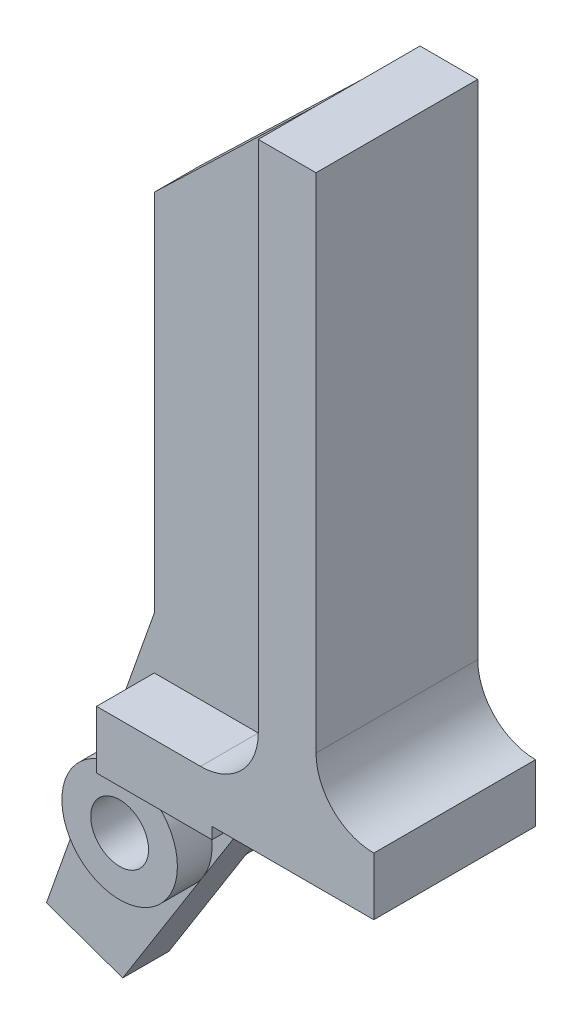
ISO-10303-21;
HEADER;
FILE_DESCRIPTION(('STEP AP214'),'2;1');
FILE_NAME('part.step','',(''),(''),'','','');
FILE_SCHEMA(('AUTOMOTIVE_DESIGN { 1 0 10303 214 1 1 1 1 }'));
ENDSEC;
DATA;
#1=APPLICATION_CONTEXT('core data for automotive mechanical design processes');
#2=APPLICATION_PROTOCOL_DEFINITION('international standard','automotive_design',2000,#1);
#3=PRODUCT_CONTEXT('',#1,'mechanical');
#4=PRODUCT('Part','Part','',(#3));
#5=PRODUCT_RELATED_PRODUCT_CATEGORY('part','',(#4));
#6=PRODUCT_DEFINITION_FORMATION('','',#4);
#7=PRODUCT_DEFINITION_CONTEXT('part definition',#1,'design');
#8=PRODUCT_DEFINITION('design','',#6,#7);
#9=PRODUCT_DEFINITION_SHAPE('','',#8);
#10=(LENGTH_UNIT() NAMED_UNIT(*) SI_UNIT(.MILLI.,.METRE.));
#11=(NAMED_UNIT(*) PLANE_ANGLE_UNIT() SI_UNIT($,.RADIAN.));
#12=(NAMED_UNIT(*) SI_UNIT($,.STERADIAN.) SOLID_ANGLE_UNIT());
#13=UNCERTAINTY_MEASURE_WITH_UNIT(LENGTH_MEASURE(1.E-05),#10,'distance_accuracy_value','');
#14=(GEOMETRIC_REPRESENTATION_CONTEXT(3) GLOBAL_UNCERTAINTY_ASSIGNED_CONTEXT((#13)) GLOBAL_UNIT_ASSIGNED_CONTEXT((#10,
#11,#12)) REPRESENTATION_CONTEXT('',''));
#15=CARTESIAN_POINT('',(0.,0.,0.));
#16=DIRECTION('',(0.,0.,1.));
#17=DIRECTION('',(1.,0.,0.));
#18=AXIS2_PLACEMENT_3D('',#15,#16,#17);
#19=CARTESIAN_POINT('',(-1.36683502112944,-6.86599324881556,1.));
#20=DIRECTION('',(-0.846365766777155,0.53260209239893,0.));
#21=DIRECTION('',(-0.53260209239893,-0.846365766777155,0.));
#22=AXIS2_PLACEMENT_3D('',#19,#20,#21);
#23=PLANE('',#22);
#24=DIRECTION('',(0.,0.,-1.));
#25=VECTOR('',#24,1.);
#26=CARTESIAN_POINT('',(4.68432905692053,2.75,1.));
#27=LINE('',#26,#25);
#28=CARTESIAN_POINT('',(4.68432905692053,2.75,1.));
#29=VERTEX_POINT('',#28);
#30=CARTESIAN_POINT('',(4.68432905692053,2.75,-1.));
#31=VERTEX_POINT('',#30);
#32=EDGE_CURVE('E224',#29,#31,#27,.T.);
#33=ORIENTED_EDGE('',*,*,#32,.F.);
#34=DIRECTION('',(0.53260209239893,0.846365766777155,0.));
#35=VECTOR('',#34,1.);
#36=CARTESIAN_POINT('',(-1.36683502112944,-6.86599324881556,1.));
#37=LINE('',#36,#35);
#38=CARTESIAN_POINT('',(2.11591441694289,-1.33150523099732,1.));
#39=VERTEX_POINT('',#38);
#40=EDGE_CURVE('E245',#39,#29,#37,.T.);
#41=ORIENTED_EDGE('',*,*,#40,.F.);
#42=CARTESIAN_POINT('',(-1.36683502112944,-6.86599324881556,1.));
#43=VERTEX_POINT('',#42);
#44=EDGE_CURVE('E246',#43,#39,#37,.T.);
#45=ORIENTED_EDGE('',*,*,#44,.F.);
#46=DIRECTION('',(0.,0.,-1.));
#47=VECTOR('',#46,1.);
#48=CARTESIAN_POINT('',(-1.36683502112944,-6.86599324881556,1.));
#49=LINE('',#48,#47);
#50=CARTESIAN_POINT('',(-1.36683502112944,-6.86599324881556,-1.));
#51=VERTEX_POINT('',#50);
#52=EDGE_CURVE('E269',#43,#51,#49,.T.);
#53=ORIENTED_EDGE('',*,*,#52,.T.);
#54=DIRECTION('',(0.53260209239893,0.846365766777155,0.));
#55=VECTOR('',#54,1.);
#56=CARTESIAN_POINT('',(-1.36683502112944,-6.86599324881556,-1.));
#57=LINE('',#56,#55);
#58=CARTESIAN_POINT('',(2.11591441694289,-1.33150523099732,-1.));
#59=VERTEX_POINT('',#58);
#60=EDGE_CURVE('E262',#51,#59,#57,.T.);
#61=ORIENTED_EDGE('',*,*,#60,.T.);
#62=EDGE_CURVE('E261',#59,#31,#57,.T.);
#63=ORIENTED_EDGE('',*,*,#62,.T.);
#64=EDGE_LOOP('',(#33,#41,#45,#53,#61,#63));
#65=FACE_BOUND('',#64,.T.);
#66=ADVANCED_FACE('F33',(#65),#23,.F.);
#67=CARTESIAN_POINT('',(-23.2883511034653,0.884433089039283,1.));
#68=DIRECTION('',(0.,0.,-1.));
#69=DIRECTION('',(-1.,0.,0.));
#70=AXIS2_PLACEMENT_3D('',#67,#68,#69);
#71=PLANE('',#70);
#72=CARTESIAN_POINT('',(4.5,7.75,1.));
#73=DIRECTION('',(0.,0.,-1.));
#74=DIRECTION('',(-1.,0.,0.));
#75=AXIS2_PLACEMENT_3D('',#72,#73,#74);
#76=CIRCLE('',#75,2.5);
#77=CARTESIAN_POINT('',(7.,7.75000000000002,1.));
#78=VERTEX_POINT('',#77);
#79=CARTESIAN_POINT('',(4.49999999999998,5.25,1.));
#80=VERTEX_POINT('',#79);
#81=EDGE_CURVE('E217',#78,#80,#76,.T.);
#82=ORIENTED_EDGE('',*,*,#81,.F.);
#83=DIRECTION('',(0.,1.,0.));
#84=VECTOR('',#83,1.);
#85=CARTESIAN_POINT('',(7.,30.,1.));
#86=LINE('',#85,#84);
#87=CARTESIAN_POINT('',(7.,30.,1.));
#88=VERTEX_POINT('',#87);
#89=EDGE_CURVE('E249',#78,#88,#86,.T.);
#90=ORIENTED_EDGE('',*,*,#89,.T.);
#91=DIRECTION('',(-0.720926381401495,-0.693011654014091,0.));
#92=VECTOR('',#91,1.);
#93=CARTESIAN_POINT('',(0.,23.2710444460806,1.));
#94=LINE('',#93,#92);
#95=CARTESIAN_POINT('',(0.,23.2710444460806,1.));
#96=VERTEX_POINT('',#95);
#97=EDGE_CURVE('E233',#88,#96,#94,.T.);
#98=ORIENTED_EDGE('',*,*,#97,.T.);
#99=DIRECTION('',(0.,-1.,0.));
#100=VECTOR('',#99,1.);
#101=CARTESIAN_POINT('',(0.,7.5,1.));
#102=LINE('',#101,#100);
#103=CARTESIAN_POINT('',(0.,7.5,1.));
#104=VERTEX_POINT('',#103);
#105=EDGE_CURVE('E236',#96,#104,#102,.T.);
#106=ORIENTED_EDGE('',*,*,#105,.T.);
#107=DIRECTION('',(-0.333333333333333,-0.942809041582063,0.));
#108=VECTOR('',#107,1.);
#109=CARTESIAN_POINT('',(-4.66666666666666,-5.69932658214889,1.));
#110=LINE('',#109,#108);
#111=CARTESIAN_POINT('',(-2.35702260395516,0.833333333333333,1.));
#112=VERTEX_POINT('',#111);
#113=EDGE_CURVE('E240',#104,#112,#110,.T.);
#114=ORIENTED_EDGE('',*,*,#113,.T.);
#115=CARTESIAN_POINT('',(0.,0.,1.));
#116=DIRECTION('',(0.,0.,-1.));
#117=DIRECTION('',(-1.,0.,0.));
#118=AXIS2_PLACEMENT_3D('',#115,#116,#117);
#119=CIRCLE('',#118,2.5);
#120=EDGE_CURVE('E285',#112,#39,#119,.T.);
#121=ORIENTED_EDGE('',*,*,#120,.T.);
#122=ORIENTED_EDGE('',*,*,#40,.T.);
#123=DIRECTION('',(1.,0.,0.));
#124=VECTOR('',#123,1.);
#125=CARTESIAN_POINT('',(-23.2883511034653,2.75,1.));
#126=LINE('',#125,#124);
#127=CARTESIAN_POINT('',(0.,2.75,1.));
#128=VERTEX_POINT('',#127);
#129=EDGE_CURVE('E226',#128,#29,#126,.T.);
#130=ORIENTED_EDGE('',*,*,#129,.F.);
#131=DIRECTION('',(0.,-1.,0.));
#132=VECTOR('',#131,1.);
#133=CARTESIAN_POINT('',(0.,0.884433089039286,1.));
#134=LINE('',#133,#132);
#135=CARTESIAN_POINT('',(0.,5.25,1.));
#136=VERTEX_POINT('',#135);
#137=EDGE_CURVE('E228',#136,#128,#134,.T.);
#138=ORIENTED_EDGE('',*,*,#137,.F.);
#139=DIRECTION('',(-1.,0.,0.));
#140=VECTOR('',#139,1.);
#141=CARTESIAN_POINT('',(-23.2883511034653,5.25,1.));
#142=LINE('',#141,#140);
#143=EDGE_CURVE('E230',#80,#136,#142,.T.);
#144=ORIENTED_EDGE('',*,*,#143,.F.);
#145=EDGE_LOOP('',(#82,#90,#98,#106,#114,#121,#122,#130,#138,#144));
#146=FACE_BOUND('',#145,.T.);
#147=ADVANCED_FACE('F420',(#146),#71,.F.);
#148=CARTESIAN_POINT('',(-23.2883511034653,0.884433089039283,-1.));
#149=DIRECTION('',(0.,0.,-1.));
#150=DIRECTION('',(-1.,0.,0.));
#151=AXIS2_PLACEMENT_3D('',#148,#149,#150);
#152=PLANE('',#151);
#153=DIRECTION('',(0.,1.,0.));
#154=VECTOR('',#153,1.);
#155=CARTESIAN_POINT('',(7.,30.,-1.));
#156=LINE('',#155,#154);
#157=CARTESIAN_POINT('',(7.,7.75000000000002,-1.));
#158=VERTEX_POINT('',#157);
#159=CARTESIAN_POINT('',(7.,30.,-1.));
#160=VERTEX_POINT('',#159);
#161=EDGE_CURVE('E237',#158,#160,#156,.T.);
#162=ORIENTED_EDGE('',*,*,#161,.F.);
#163=CARTESIAN_POINT('',(4.5,7.75,-1.));
#164=DIRECTION('',(0.,0.,-1.));
#165=DIRECTION('',(-1.,0.,0.));
#166=AXIS2_PLACEMENT_3D('',#163,#164,#165);
#167=CIRCLE('',#166,2.5);
#168=CARTESIAN_POINT('',(4.49999999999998,5.25,-1.));
#169=VERTEX_POINT('',#168);
#170=EDGE_CURVE('E214',#158,#169,#167,.T.);
#171=ORIENTED_EDGE('',*,*,#170,.T.);
#172=DIRECTION('',(-1.,0.,0.));
#173=VECTOR('',#172,1.);
#174=CARTESIAN_POINT('',(-23.2883511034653,5.25,-1.));
#175=LINE('',#174,#173);
#176=CARTESIAN_POINT('',(0.,5.25,-1.));
#177=VERTEX_POINT('',#176);
#178=EDGE_CURVE('E11',#169,#177,#175,.T.);
#179=ORIENTED_EDGE('',*,*,#178,.T.);
#180=DIRECTION('',(0.,-1.,0.));
#181=VECTOR('',#180,1.);
#182=CARTESIAN_POINT('',(0.,0.884433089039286,-1.));
#183=LINE('',#182,#181);
#184=CARTESIAN_POINT('',(0.,2.75,-1.));
#185=VERTEX_POINT('',#184);
#186=EDGE_CURVE('E41',#177,#185,#183,.T.);
#187=ORIENTED_EDGE('',*,*,#186,.T.);
#188=DIRECTION('',(1.,0.,0.));
#189=VECTOR('',#188,1.);
#190=CARTESIAN_POINT('',(-23.2883511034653,2.75,-1.));
#191=LINE('',#190,#189);
#192=EDGE_CURVE('E296',#185,#31,#191,.T.);
#193=ORIENTED_EDGE('',*,*,#192,.T.);
#194=ORIENTED_EDGE('',*,*,#62,.F.);
#195=CARTESIAN_POINT('',(0.,0.,-1.));
#196=DIRECTION('',(0.,0.,-1.));
#197=DIRECTION('',(-1.,0.,0.));
#198=AXIS2_PLACEMENT_3D('',#195,#196,#197);
#199=CIRCLE('',#198,2.5);
#200=CARTESIAN_POINT('',(-2.35702260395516,0.833333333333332,-1.));
#201=VERTEX_POINT('',#200);
#202=EDGE_CURVE('E283',#201,#59,#199,.T.);
#203=ORIENTED_EDGE('',*,*,#202,.F.);
#204=DIRECTION('',(-0.333333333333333,-0.942809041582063,0.));
#205=VECTOR('',#204,1.);
#206=CARTESIAN_POINT('',(-4.66666666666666,-5.69932658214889,-1.));
#207=LINE('',#206,#205);
#208=CARTESIAN_POINT('',(0.,7.5,-1.));
#209=VERTEX_POINT('',#208);
#210=EDGE_CURVE('E48',#209,#201,#207,.T.);
#211=ORIENTED_EDGE('',*,*,#210,.F.);
#212=DIRECTION('',(0.,-1.,0.));
#213=VECTOR('',#212,1.);
#214=CARTESIAN_POINT('',(0.,7.5,-1.));
#215=LINE('',#214,#213);
#216=CARTESIAN_POINT('',(0.,23.2710444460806,-1.));
#217=VERTEX_POINT('',#216);
#218=EDGE_CURVE('E255',#217,#209,#215,.T.);
#219=ORIENTED_EDGE('',*,*,#218,.F.);
#220=DIRECTION('',(-0.720926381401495,-0.693011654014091,0.));
#221=VECTOR('',#220,1.);
#222=CARTESIAN_POINT('',(0.,23.2710444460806,-1.));
#223=LINE('',#222,#221);
#224=EDGE_CURVE('E232',#160,#217,#223,.T.);
#225=ORIENTED_EDGE('',*,*,#224,.F.);
#226=EDGE_LOOP('',(#162,#171,#179,#187,#193,#194,#203,#211,#219,#225));
#227=FACE_BOUND('',#226,.T.);
#228=ADVANCED_FACE('F303',(#227),#152,.T.);
#229=CARTESIAN_POINT('',(0.,0.,2.5));
#230=DIRECTION('',(0.,0.,-1.));
#231=DIRECTION('',(-1.,0.,0.));
#232=AXIS2_PLACEMENT_3D('',#229,#230,#231);
#233=CYLINDRICAL_SURFACE('',#232,2.5);
#234=CARTESIAN_POINT('',(0.,0.,2.5));
#235=DIRECTION('',(0.,0.,1.));
#236=DIRECTION('',(1.,0.,0.));
#237=AXIS2_PLACEMENT_3D('',#234,#235,#236);
#238=CIRCLE('',#237,2.5);
#239=CARTESIAN_POINT('',(2.5,0.,2.5));
#240=VERTEX_POINT('',#239);
#241=EDGE_CURVE('E293',#240,#240,#238,.T.);
#242=ORIENTED_EDGE('',*,*,#241,.F.);
#243=EDGE_LOOP('',(#242));
#244=FACE_BOUND('',#243,.T.);
#245=ORIENTED_EDGE('',*,*,#120,.F.);
#246=EDGE_CURVE('E55',#39,#112,#119,.T.);
#247=ORIENTED_EDGE('',*,*,#246,.F.);
#248=EDGE_LOOP('',(#245,#247));
#249=FACE_BOUND('',#248,.T.);
#250=ADVANCED_FACE('F444',(#244,#249),#233,.T.);
#251=CARTESIAN_POINT('',(0.,0.,2.5));
#252=DIRECTION('',(0.,0.,1.));
#253=DIRECTION('',(1.,0.,0.));
#254=AXIS2_PLACEMENT_3D('',#251,#252,#253);
#255=PLANE('',#254);
#256=ORIENTED_EDGE('',*,*,#241,.T.);
#257=EDGE_LOOP('',(#256));
#258=FACE_BOUND('',#257,.T.);
#259=CARTESIAN_POINT('',(0.,0.,2.5));
#260=DIRECTION('',(0.,0.,1.));
#261=DIRECTION('',(1.,0.,0.));
#262=AXIS2_PLACEMENT_3D('',#259,#260,#261);
#263=CIRCLE('',#262,1.25);
#264=CARTESIAN_POINT('',(1.25,0.,2.5));
#265=VERTEX_POINT('',#264);
#266=EDGE_CURVE('E286',#265,#265,#263,.T.);
#267=ORIENTED_EDGE('',*,*,#266,.F.);
#268=EDGE_LOOP('',(#267));
#269=FACE_BOUND('',#268,.T.);
#270=ADVANCED_FACE('F449',(#258,#269),#255,.T.);
#271=CARTESIAN_POINT('',(0.,0.,-2.5));
#272=DIRECTION('',(0.,0.,1.));
#273=DIRECTION('',(1.,0.,0.));
#274=AXIS2_PLACEMENT_3D('',#271,#272,#273);
#275=PLANE('',#274);
#276=CARTESIAN_POINT('',(0.,0.,-2.5));
#277=DIRECTION('',(0.,0.,1.));
#278=DIRECTION('',(1.,0.,0.));
#279=AXIS2_PLACEMENT_3D('',#276,#277,#278);
#280=CIRCLE('',#279,2.5);
#281=CARTESIAN_POINT('',(2.5,0.,-2.5));
#282=VERTEX_POINT('',#281);
#283=EDGE_CURVE('E289',#282,#282,#280,.T.);
#284=ORIENTED_EDGE('',*,*,#283,.F.);
#285=EDGE_LOOP('',(#284));
#286=FACE_BOUND('',#285,.T.);
#287=CARTESIAN_POINT('',(0.,0.,-2.5));
#288=DIRECTION('',(0.,0.,1.));
#289=DIRECTION('',(1.,0.,0.));
#290=AXIS2_PLACEMENT_3D('',#287,#288,#289);
#291=CIRCLE('',#290,1.25);
#292=CARTESIAN_POINT('',(1.25,0.,-2.5));
#293=VERTEX_POINT('',#292);
#294=EDGE_CURVE('E290',#293,#293,#291,.T.);
#295=ORIENTED_EDGE('',*,*,#294,.T.);
#296=EDGE_LOOP('',(#295));
#297=FACE_BOUND('',#296,.T.);
#298=ADVANCED_FACE('F443',(#286,#297),#275,.F.);
#299=EDGE_CURVE('E280',#59,#201,#199,.T.);
#300=ORIENTED_EDGE('',*,*,#299,.T.);
#301=ORIENTED_EDGE('',*,*,#202,.T.);
#302=EDGE_LOOP('',(#300,#301));
#303=FACE_BOUND('',#302,.T.);
#304=ORIENTED_EDGE('',*,*,#283,.T.);
#305=EDGE_LOOP('',(#304));
#306=FACE_BOUND('',#305,.T.);
#307=ADVANCED_FACE('F35',(#303,#306),#233,.T.);
#308=CARTESIAN_POINT('',(0.,0.,2.5));
#309=DIRECTION('',(0.,0.,-1.));
#310=DIRECTION('',(-1.,0.,0.));
#311=AXIS2_PLACEMENT_3D('',#308,#309,#310);
#312=CYLINDRICAL_SURFACE('',#311,1.25);
#313=ORIENTED_EDGE('',*,*,#294,.F.);
#314=EDGE_LOOP('',(#313));
#315=FACE_BOUND('',#314,.T.);
#316=ORIENTED_EDGE('',*,*,#266,.T.);
#317=EDGE_LOOP('',(#316));
#318=FACE_BOUND('',#317,.T.);
#319=ADVANCED_FACE('F442',(#315,#318),#312,.F.);
#320=CARTESIAN_POINT('',(-4.66666666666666,-5.69932658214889,1.));
#321=DIRECTION('',(0.942809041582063,-0.333333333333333,0.));
#322=DIRECTION('',(0.333333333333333,0.942809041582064,0.));
#323=AXIS2_PLACEMENT_3D('',#320,#321,#322);
#324=PLANE('',#323);
#325=CARTESIAN_POINT('',(-4.66666666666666,-5.69932658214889,1.));
#326=VERTEX_POINT('',#325);
#327=EDGE_CURVE('E239',#112,#326,#110,.T.);
#328=ORIENTED_EDGE('',*,*,#327,.F.);
#329=ORIENTED_EDGE('',*,*,#113,.F.);
#330=DIRECTION('',(0.,0.,-1.));
#331=VECTOR('',#330,1.);
#332=CARTESIAN_POINT('',(0.,7.5,1.));
#333=LINE('',#332,#331);
#334=EDGE_CURVE('E275',#104,#209,#333,.T.);
#335=ORIENTED_EDGE('',*,*,#334,.T.);
#336=ORIENTED_EDGE('',*,*,#210,.T.);
#337=CARTESIAN_POINT('',(-4.66666666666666,-5.69932658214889,-1.));
#338=VERTEX_POINT('',#337);
#339=EDGE_CURVE('E257',#201,#338,#207,.T.);
#340=ORIENTED_EDGE('',*,*,#339,.T.);
#341=DIRECTION('',(0.,0.,-1.));
#342=VECTOR('',#341,1.);
#343=CARTESIAN_POINT('',(-4.66666666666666,-5.69932658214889,1.));
#344=LINE('',#343,#342);
#345=EDGE_CURVE('E272',#326,#338,#344,.T.);
#346=ORIENTED_EDGE('',*,*,#345,.F.);
#347=EDGE_LOOP('',(#328,#329,#335,#336,#340,#346));
#348=FACE_BOUND('',#347,.T.);
#349=ADVANCED_FACE('F454',(#348),#324,.F.);
#350=ORIENTED_EDGE('',*,*,#44,.T.);
#351=ORIENTED_EDGE('',*,*,#246,.T.);
#352=ORIENTED_EDGE('',*,*,#327,.T.);
#353=DIRECTION('',(0.942809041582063,-0.333333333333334,0.));
#354=VECTOR('',#353,1.);
#355=CARTESIAN_POINT('',(-4.66666666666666,-5.69932658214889,1.));
#356=LINE('',#355,#354);
#357=EDGE_CURVE('E243',#326,#43,#356,.T.);
#358=ORIENTED_EDGE('',*,*,#357,.T.);
#359=EDGE_LOOP('',(#350,#351,#352,#358));
#360=FACE_BOUND('',#359,.T.);
#361=ADVANCED_FACE('F426',(#360),#71,.F.);
#362=ORIENTED_EDGE('',*,*,#299,.F.);
#363=ORIENTED_EDGE('',*,*,#60,.F.);
#364=DIRECTION('',(0.942809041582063,-0.333333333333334,0.));
#365=VECTOR('',#364,1.);
#366=CARTESIAN_POINT('',(-4.66666666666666,-5.69932658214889,-1.));
#367=LINE('',#366,#365);
#368=EDGE_CURVE('E259',#338,#51,#367,.T.);
#369=ORIENTED_EDGE('',*,*,#368,.F.);
#370=ORIENTED_EDGE('',*,*,#339,.F.);
#371=EDGE_LOOP('',(#362,#363,#369,#370));
#372=FACE_BOUND('',#371,.T.);
#373=ADVANCED_FACE('F437',(#372),#152,.T.);
#374=CARTESIAN_POINT('',(0.,23.2710444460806,1.));
#375=DIRECTION('',(0.693011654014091,-0.720926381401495,0.));
#376=DIRECTION('',(0.720926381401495,0.693011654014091,0.));
#377=AXIS2_PLACEMENT_3D('',#374,#375,#376);
#378=PLANE('',#377);
#379=ORIENTED_EDGE('',*,*,#224,.T.);
#380=DIRECTION('',(0.,0.,-1.));
#381=VECTOR('',#380,1.);
#382=CARTESIAN_POINT('',(0.,23.2710444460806,1.));
#383=LINE('',#382,#381);
#384=EDGE_CURVE('E277',#96,#217,#383,.T.);
#385=ORIENTED_EDGE('',*,*,#384,.F.);
#386=ORIENTED_EDGE('',*,*,#97,.F.);
#387=DIRECTION('',(0.,0.,-1.));
#388=VECTOR('',#387,1.);
#389=CARTESIAN_POINT('',(7.,30.,1.));
#390=LINE('',#389,#388);
#391=EDGE_CURVE('E252',#88,#160,#390,.T.);
#392=ORIENTED_EDGE('',*,*,#391,.T.);
#393=EDGE_LOOP('',(#379,#385,#386,#392));
#394=FACE_BOUND('',#393,.T.);
#395=ADVANCED_FACE('F481',(#394),#378,.F.);
#396=CARTESIAN_POINT('',(0.,7.5,1.));
#397=DIRECTION('',(1.,0.,0.));
#398=DIRECTION('',(0.,0.,-1.));
#399=AXIS2_PLACEMENT_3D('',#396,#397,#398);
#400=PLANE('',#399);
#401=ORIENTED_EDGE('',*,*,#218,.T.);
#402=ORIENTED_EDGE('',*,*,#334,.F.);
#403=ORIENTED_EDGE('',*,*,#105,.F.);
#404=ORIENTED_EDGE('',*,*,#384,.T.);
#405=EDGE_LOOP('',(#401,#402,#403,#404));
#406=FACE_BOUND('',#405,.T.);
#407=ADVANCED_FACE('F476',(#406),#400,.F.);
#408=CARTESIAN_POINT('',(-4.66666666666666,-5.69932658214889,1.));
#409=DIRECTION('',(0.333333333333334,0.942809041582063,0.));
#410=DIRECTION('',(-0.942809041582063,0.333333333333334,0.));
#411=AXIS2_PLACEMENT_3D('',#408,#409,#410);
#412=PLANE('',#411);
#413=ORIENTED_EDGE('',*,*,#368,.T.);
#414=ORIENTED_EDGE('',*,*,#52,.F.);
#415=ORIENTED_EDGE('',*,*,#357,.F.);
#416=ORIENTED_EDGE('',*,*,#345,.T.);
#417=EDGE_LOOP('',(#413,#414,#415,#416));
#418=FACE_BOUND('',#417,.T.);
#419=ADVANCED_FACE('F432',(#418),#412,.F.);
#420=CARTESIAN_POINT('',(0.,5.25,3.5));
#421=DIRECTION('',(0.,-1.,0.));
#422=DIRECTION('',(1.,0.,0.));
#423=AXIS2_PLACEMENT_3D('',#420,#421,#422);
#424=PLANE('',#423);
#425=DIRECTION('',(0.,0.,-1.));
#426=VECTOR('',#425,1.);
#427=CARTESIAN_POINT('',(4.49999999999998,5.25,3.5));
#428=LINE('',#427,#426);
#429=CARTESIAN_POINT('',(4.49999999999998,5.25,3.5));
#430=VERTEX_POINT('',#429);
#431=EDGE_CURVE('E329',#430,#80,#428,.T.);
#432=ORIENTED_EDGE('',*,*,#431,.T.);
#433=ORIENTED_EDGE('',*,*,#143,.T.);
#434=DIRECTION('',(0.,0.,-1.));
#435=VECTOR('',#434,1.);
#436=CARTESIAN_POINT('',(0.,5.25,3.5));
#437=LINE('',#436,#435);
#438=CARTESIAN_POINT('',(0.,5.25,3.5));
#439=VERTEX_POINT('',#438);
#440=EDGE_CURVE('E320',#439,#136,#437,.T.);
#441=ORIENTED_EDGE('',*,*,#440,.F.);
#442=DIRECTION('',(-1.,0.,0.));
#443=VECTOR('',#442,1.);
#444=CARTESIAN_POINT('',(0.,5.25,3.5));
#445=LINE('',#444,#443);
#446=EDGE_CURVE('E407',#430,#439,#445,.T.);
#447=ORIENTED_EDGE('',*,*,#446,.F.);
#448=EDGE_LOOP('',(#432,#433,#441,#447));
#449=FACE_BOUND('',#448,.T.);
#450=ADVANCED_FACE('F475',(#449),#424,.F.);
#451=CARTESIAN_POINT('',(0.,5.25,3.5));
#452=DIRECTION('',(1.,0.,0.));
#453=DIRECTION('',(0.,1.,0.));
#454=AXIS2_PLACEMENT_3D('',#451,#452,#453);
#455=PLANE('',#454);
#456=ORIENTED_EDGE('',*,*,#440,.T.);
#457=ORIENTED_EDGE('',*,*,#137,.T.);
#458=DIRECTION('',(0.,0.,-1.));
#459=VECTOR('',#458,1.);
#460=CARTESIAN_POINT('',(0.,2.75,3.5));
#461=LINE('',#460,#459);
#462=CARTESIAN_POINT('',(0.,2.75,3.5));
#463=VERTEX_POINT('',#462);
#464=EDGE_CURVE('E321',#463,#128,#461,.T.);
#465=ORIENTED_EDGE('',*,*,#464,.F.);
#466=DIRECTION('',(0.,-1.,0.));
#467=VECTOR('',#466,1.);
#468=CARTESIAN_POINT('',(0.,5.25,3.5));
#469=LINE('',#468,#467);
#470=EDGE_CURVE('E409',#439,#463,#469,.T.);
#471=ORIENTED_EDGE('',*,*,#470,.F.);
#472=EDGE_LOOP('',(#456,#457,#465,#471));
#473=FACE_BOUND('',#472,.T.);
#474=ADVANCED_FACE('F525',(#473),#455,.F.);
#475=CARTESIAN_POINT('',(0.,2.75,3.5));
#476=DIRECTION('',(0.,1.,0.));
#477=DIRECTION('',(-1.,0.,0.));
#478=AXIS2_PLACEMENT_3D('',#475,#476,#477);
#479=PLANE('',#478);
#480=ORIENTED_EDGE('',*,*,#464,.T.);
#481=ORIENTED_EDGE('',*,*,#129,.T.);
#482=ORIENTED_EDGE('',*,*,#32,.T.);
#483=ORIENTED_EDGE('',*,*,#192,.F.);
#484=CARTESIAN_POINT('',(0.,2.75,-3.5));
#485=VERTEX_POINT('',#484);
#486=EDGE_CURVE('E313',#185,#485,#461,.T.);
#487=ORIENTED_EDGE('',*,*,#486,.T.);
#488=DIRECTION('',(1.,0.,0.));
#489=VECTOR('',#488,1.);
#490=CARTESIAN_POINT('',(0.,2.75,-3.5));
#491=LINE('',#490,#489);
#492=CARTESIAN_POINT('',(4.99896967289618,2.75,-3.5));
#493=VERTEX_POINT('',#492);
#494=EDGE_CURVE('E370',#485,#493,#491,.T.);
#495=ORIENTED_EDGE('',*,*,#494,.T.);
#496=DIRECTION('',(0.,0.,-1.));
#497=VECTOR('',#496,1.);
#498=CARTESIAN_POINT('',(4.99896967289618,2.75,3.5));
#499=LINE('',#498,#497);
#500=CARTESIAN_POINT('',(4.99896967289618,2.75,3.5));
#501=VERTEX_POINT('',#500);
#502=EDGE_CURVE('E379',#501,#493,#499,.T.);
#503=ORIENTED_EDGE('',*,*,#502,.F.);
#504=DIRECTION('',(1.,0.,0.));
#505=VECTOR('',#504,1.);
#506=CARTESIAN_POINT('',(0.,2.75,3.5));
#507=LINE('',#506,#505);
#508=EDGE_CURVE('E395',#463,#501,#507,.T.);
#509=ORIENTED_EDGE('',*,*,#508,.F.);
#510=EDGE_LOOP('',(#480,#481,#482,#483,#487,#495,#503,#509));
#511=FACE_BOUND('',#510,.T.);
#512=ADVANCED_FACE('F386',(#511),#479,.F.);
#513=CARTESIAN_POINT('',(7.,7.75000000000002,3.5));
#514=DIRECTION('',(1.,0.,0.));
#515=DIRECTION('',(0.,1.,0.));
#516=AXIS2_PLACEMENT_3D('',#513,#514,#515);
#517=PLANE('',#516);
#518=DIRECTION('',(0.,0.,-1.));
#519=VECTOR('',#518,1.);
#520=CARTESIAN_POINT('',(7.,30.,3.5));
#521=LINE('',#520,#519);
#522=CARTESIAN_POINT('',(7.,30.,3.5));
#523=VERTEX_POINT('',#522);
#524=EDGE_CURVE('E337',#523,#88,#521,.T.);
#525=ORIENTED_EDGE('',*,*,#524,.T.);
#526=ORIENTED_EDGE('',*,*,#89,.F.);
#527=DIRECTION('',(0.,0.,-1.));
#528=VECTOR('',#527,1.);
#529=CARTESIAN_POINT('',(7.,7.75000000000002,3.5));
#530=LINE('',#529,#528);
#531=CARTESIAN_POINT('',(7.,7.75000000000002,3.5));
#532=VERTEX_POINT('',#531);
#533=EDGE_CURVE('E333',#532,#78,#530,.T.);
#534=ORIENTED_EDGE('',*,*,#533,.F.);
#535=DIRECTION('',(0.,-1.,0.));
#536=VECTOR('',#535,1.);
#537=CARTESIAN_POINT('',(7.,7.75000000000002,3.5));
#538=LINE('',#537,#536);
#539=EDGE_CURVE('E401',#523,#532,#538,.T.);
#540=ORIENTED_EDGE('',*,*,#539,.F.);
#541=EDGE_LOOP('',(#525,#526,#534,#540));
#542=FACE_BOUND('',#541,.T.);
#543=ADVANCED_FACE('F495',(#542),#517,.F.);
#544=CARTESIAN_POINT('',(4.5,7.75,3.5));
#545=DIRECTION('',(0.,0.,-1.));
#546=DIRECTION('',(-1.,0.,0.));
#547=AXIS2_PLACEMENT_3D('',#544,#545,#546);
#548=CYLINDRICAL_SURFACE('',#547,2.5);
#549=ORIENTED_EDGE('',*,*,#533,.T.);
#550=ORIENTED_EDGE('',*,*,#81,.T.);
#551=ORIENTED_EDGE('',*,*,#431,.F.);
#552=CARTESIAN_POINT('',(4.5,7.75,3.5));
#553=DIRECTION('',(0.,0.,-1.));
#554=DIRECTION('',(-1.,0.,0.));
#555=AXIS2_PLACEMENT_3D('',#552,#553,#554);
#556=CIRCLE('',#555,2.5);
#557=EDGE_CURVE('E405',#532,#430,#556,.T.);
#558=ORIENTED_EDGE('',*,*,#557,.F.);
#559=EDGE_LOOP('',(#549,#550,#551,#558));
#560=FACE_BOUND('',#559,.T.);
#561=ADVANCED_FACE('F499',(#560),#548,.F.);
#562=CARTESIAN_POINT('',(12.,3.25,3.5));
#563=DIRECTION('',(-1.,0.,0.));
#564=DIRECTION('',(0.,-1.,0.));
#565=AXIS2_PLACEMENT_3D('',#562,#563,#564);
#566=PLANE('',#565);
#567=DIRECTION('',(0.,1.,0.));
#568=VECTOR('',#567,1.);
#569=CARTESIAN_POINT('',(12.,3.25,-3.5));
#570=LINE('',#569,#568);
#571=CARTESIAN_POINT('',(12.,3.25,-3.5));
#572=VERTEX_POINT('',#571);
#573=CARTESIAN_POINT('',(12.,5.75,-3.5));
#574=VERTEX_POINT('',#573);
#575=EDGE_CURVE('E213',#572,#574,#570,.T.);
#576=ORIENTED_EDGE('',*,*,#575,.T.);
#577=DIRECTION('',(0.,0.,-1.));
#578=VECTOR('',#577,1.);
#579=CARTESIAN_POINT('',(12.,5.75,3.5));
#580=LINE('',#579,#578);
#581=CARTESIAN_POINT('',(12.,5.75,3.5));
#582=VERTEX_POINT('',#581);
#583=EDGE_CURVE('E193',#582,#574,#580,.T.);
#584=ORIENTED_EDGE('',*,*,#583,.F.);
#585=DIRECTION('',(0.,1.,0.));
#586=VECTOR('',#585,1.);
#587=CARTESIAN_POINT('',(12.,3.25,3.5));
#588=LINE('',#587,#586);
#589=CARTESIAN_POINT('',(12.,3.25,3.5));
#590=VERTEX_POINT('',#589);
#591=EDGE_CURVE('E200',#590,#582,#588,.T.);
#592=ORIENTED_EDGE('',*,*,#591,.F.);
#593=DIRECTION('',(0.,0.,-1.));
#594=VECTOR('',#593,1.);
#595=CARTESIAN_POINT('',(12.,3.25,3.5));
#596=LINE('',#595,#594);
#597=EDGE_CURVE('E376',#590,#572,#596,.T.);
#598=ORIENTED_EDGE('',*,*,#597,.T.);
#599=EDGE_LOOP('',(#576,#584,#592,#598));
#600=FACE_BOUND('',#599,.T.);
#601=ADVANCED_FACE('F211',(#600),#566,.F.);
#602=CARTESIAN_POINT('',(12.,8.25,3.5));
#603=DIRECTION('',(0.,0.,-1.));
#604=DIRECTION('',(-1.,0.,0.));
#605=AXIS2_PLACEMENT_3D('',#602,#603,#604);
#606=CYLINDRICAL_SURFACE('',#605,2.5);
#607=CARTESIAN_POINT('',(12.,8.25,-3.5));
#608=DIRECTION('',(0.,0.,-1.));
#609=DIRECTION('',(1.,0.,0.));
#610=AXIS2_PLACEMENT_3D('',#607,#608,#609);
#611=CIRCLE('',#610,2.5);
#612=CARTESIAN_POINT('',(9.5,8.25,-3.5));
#613=VERTEX_POINT('',#612);
#614=EDGE_CURVE('E361',#574,#613,#611,.T.);
#615=ORIENTED_EDGE('',*,*,#614,.T.);
#616=DIRECTION('',(0.,0.,-1.));
#617=VECTOR('',#616,1.);
#618=CARTESIAN_POINT('',(9.5,8.25,3.5));
#619=LINE('',#618,#617);
#620=CARTESIAN_POINT('',(9.5,8.25,3.5));
#621=VERTEX_POINT('',#620);
#622=EDGE_CURVE('E196',#621,#613,#619,.T.);
#623=ORIENTED_EDGE('',*,*,#622,.F.);
#624=CARTESIAN_POINT('',(12.,8.25,3.5));
#625=DIRECTION('',(0.,0.,-1.));
#626=DIRECTION('',(1.,0.,0.));
#627=AXIS2_PLACEMENT_3D('',#624,#625,#626);
#628=CIRCLE('',#627,2.5);
#629=EDGE_CURVE('E189',#582,#621,#628,.T.);
#630=ORIENTED_EDGE('',*,*,#629,.F.);
#631=ORIENTED_EDGE('',*,*,#583,.T.);
#632=EDGE_LOOP('',(#615,#623,#630,#631));
#633=FACE_BOUND('',#632,.T.);
#634=ADVANCED_FACE('F191',(#633),#606,.F.);
#635=CARTESIAN_POINT('',(9.5,8.25,3.5));
#636=DIRECTION('',(-1.,0.,0.));
#637=DIRECTION('',(0.,-1.,0.));
#638=AXIS2_PLACEMENT_3D('',#635,#636,#637);
#639=PLANE('',#638);
#640=DIRECTION('',(0.,1.,0.));
#641=VECTOR('',#640,1.);
#642=CARTESIAN_POINT('',(9.5,8.25,-3.5));
#643=LINE('',#642,#641);
#644=CARTESIAN_POINT('',(9.5,30.,-3.5));
#645=VERTEX_POINT('',#644);
#646=EDGE_CURVE('E354',#613,#645,#643,.T.);
#647=ORIENTED_EDGE('',*,*,#646,.T.);
#648=DIRECTION('',(0.,0.,-1.));
#649=VECTOR('',#648,1.);
#650=CARTESIAN_POINT('',(9.5,30.,3.5));
#651=LINE('',#650,#649);
#652=CARTESIAN_POINT('',(9.5,30.,3.5));
#653=VERTEX_POINT('',#652);
#654=EDGE_CURVE('E219',#653,#645,#651,.T.);
#655=ORIENTED_EDGE('',*,*,#654,.F.);
#656=DIRECTION('',(0.,1.,0.));
#657=VECTOR('',#656,1.);
#658=CARTESIAN_POINT('',(9.5,8.25,3.5));
#659=LINE('',#658,#657);
#660=EDGE_CURVE('E199',#621,#653,#659,.T.);
#661=ORIENTED_EDGE('',*,*,#660,.F.);
#662=ORIENTED_EDGE('',*,*,#622,.T.);
#663=EDGE_LOOP('',(#647,#655,#661,#662));
#664=FACE_BOUND('',#663,.T.);
#665=ADVANCED_FACE('F399',(#664),#639,.F.);
#666=CARTESIAN_POINT('',(7.,30.,3.5));
#667=DIRECTION('',(0.,-1.,0.));
#668=DIRECTION('',(0.,0.,-1.));
#669=AXIS2_PLACEMENT_3D('',#666,#667,#668);
#670=PLANE('',#669);
#671=DIRECTION('',(-1.,0.,0.));
#672=VECTOR('',#671,1.);
#673=CARTESIAN_POINT('',(7.,30.,-3.5));
#674=LINE('',#673,#672);
#675=CARTESIAN_POINT('',(7.,30.,-3.5));
#676=VERTEX_POINT('',#675);
#677=EDGE_CURVE('E346',#645,#676,#674,.T.);
#678=ORIENTED_EDGE('',*,*,#677,.T.);
#679=EDGE_CURVE('E336',#160,#676,#521,.T.);
#680=ORIENTED_EDGE('',*,*,#679,.F.);
#681=ORIENTED_EDGE('',*,*,#391,.F.);
#682=ORIENTED_EDGE('',*,*,#524,.F.);
#683=DIRECTION('',(-1.,0.,0.));
#684=VECTOR('',#683,1.);
#685=CARTESIAN_POINT('',(7.,30.,3.5));
#686=LINE('',#685,#684);
#687=EDGE_CURVE('E349',#653,#523,#686,.T.);
#688=ORIENTED_EDGE('',*,*,#687,.F.);
#689=ORIENTED_EDGE('',*,*,#654,.T.);
#690=EDGE_LOOP('',(#678,#680,#681,#682,#688,#689));
#691=FACE_BOUND('',#690,.T.);
#692=ADVANCED_FACE('F345',(#691),#670,.F.);
#693=ORIENTED_EDGE('',*,*,#161,.T.);
#694=ORIENTED_EDGE('',*,*,#679,.T.);
#695=DIRECTION('',(0.,-1.,0.));
#696=VECTOR('',#695,1.);
#697=CARTESIAN_POINT('',(7.,7.75000000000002,-3.5));
#698=LINE('',#697,#696);
#699=CARTESIAN_POINT('',(7.,7.75000000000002,-3.5));
#700=VERTEX_POINT('',#699);
#701=EDGE_CURVE('E357',#676,#700,#698,.T.);
#702=ORIENTED_EDGE('',*,*,#701,.T.);
#703=EDGE_CURVE('E332',#158,#700,#530,.T.);
#704=ORIENTED_EDGE('',*,*,#703,.F.);
#705=EDGE_LOOP('',(#693,#694,#702,#704));
#706=FACE_BOUND('',#705,.T.);
#707=ADVANCED_FACE('F505',(#706),#517,.F.);
#708=ORIENTED_EDGE('',*,*,#170,.F.);
#709=ORIENTED_EDGE('',*,*,#703,.T.);
#710=CARTESIAN_POINT('',(4.5,7.75,-3.5));
#711=DIRECTION('',(0.,0.,-1.));
#712=DIRECTION('',(-1.,0.,0.));
#713=AXIS2_PLACEMENT_3D('',#710,#711,#712);
#714=CIRCLE('',#713,2.5);
#715=CARTESIAN_POINT('',(4.49999999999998,5.25,-3.5));
#716=VERTEX_POINT('',#715);
#717=EDGE_CURVE('E359',#700,#716,#714,.T.);
#718=ORIENTED_EDGE('',*,*,#717,.T.);
#719=EDGE_CURVE('E324',#169,#716,#428,.T.);
#720=ORIENTED_EDGE('',*,*,#719,.F.);
#721=EDGE_LOOP('',(#708,#709,#718,#720));
#722=FACE_BOUND('',#721,.T.);
#723=ADVANCED_FACE('F507',(#722),#548,.F.);
#724=ORIENTED_EDGE('',*,*,#178,.F.);
#725=ORIENTED_EDGE('',*,*,#719,.T.);
#726=DIRECTION('',(-1.,0.,0.));
#727=VECTOR('',#726,1.);
#728=CARTESIAN_POINT('',(0.,5.25,-3.5));
#729=LINE('',#728,#727);
#730=CARTESIAN_POINT('',(0.,5.25,-3.5));
#731=VERTEX_POINT('',#730);
#732=EDGE_CURVE('E318',#716,#731,#729,.T.);
#733=ORIENTED_EDGE('',*,*,#732,.T.);
#734=EDGE_CURVE('E311',#177,#731,#437,.T.);
#735=ORIENTED_EDGE('',*,*,#734,.F.);
#736=EDGE_LOOP('',(#724,#725,#733,#735));
#737=FACE_BOUND('',#736,.T.);
#738=ADVANCED_FACE('F315',(#737),#424,.F.);
#739=ORIENTED_EDGE('',*,*,#186,.F.);
#740=ORIENTED_EDGE('',*,*,#734,.T.);
#741=DIRECTION('',(0.,-1.,0.));
#742=VECTOR('',#741,1.);
#743=CARTESIAN_POINT('',(0.,5.25,-3.5));
#744=LINE('',#743,#742);
#745=EDGE_CURVE('E368',#731,#485,#744,.T.);
#746=ORIENTED_EDGE('',*,*,#745,.T.);
#747=ORIENTED_EDGE('',*,*,#486,.F.);
#748=EDGE_LOOP('',(#739,#740,#746,#747));
#749=FACE_BOUND('',#748,.T.);
#750=ADVANCED_FACE('F309',(#749),#455,.F.);
#751=CARTESIAN_POINT('',(4.99896967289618,3.25,3.5));
#752=DIRECTION('',(-1.,0.,0.));
#753=DIRECTION('',(0.,0.,1.));
#754=AXIS2_PLACEMENT_3D('',#751,#752,#753);
#755=PLANE('',#754);
#756=DIRECTION('',(0.,1.,0.));
#757=VECTOR('',#756,1.);
#758=CARTESIAN_POINT('',(4.99896967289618,3.25,-3.5));
#759=LINE('',#758,#757);
#760=CARTESIAN_POINT('',(4.99896967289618,3.25,-3.5));
#761=VERTEX_POINT('',#760);
#762=EDGE_CURVE('E372',#493,#761,#759,.T.);
#763=ORIENTED_EDGE('',*,*,#762,.T.);
#764=DIRECTION('',(0.,0.,-1.));
#765=VECTOR('',#764,1.);
#766=CARTESIAN_POINT('',(4.99896967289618,3.25,3.5));
#767=LINE('',#766,#765);
#768=CARTESIAN_POINT('',(4.99896967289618,3.25,3.5));
#769=VERTEX_POINT('',#768);
#770=EDGE_CURVE('E378',#769,#761,#767,.T.);
#771=ORIENTED_EDGE('',*,*,#770,.F.);
#772=DIRECTION('',(0.,1.,0.));
#773=VECTOR('',#772,1.);
#774=CARTESIAN_POINT('',(4.99896967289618,3.25,3.5));
#775=LINE('',#774,#773);
#776=EDGE_CURVE('E391',#501,#769,#775,.T.);
#777=ORIENTED_EDGE('',*,*,#776,.F.);
#778=ORIENTED_EDGE('',*,*,#502,.T.);
#779=EDGE_LOOP('',(#763,#771,#777,#778));
#780=FACE_BOUND('',#779,.T.);
#781=ADVANCED_FACE('F390',(#780),#755,.F.);
#782=CARTESIAN_POINT('',(4.99896967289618,3.25,3.5));
#783=DIRECTION('',(0.,1.,0.));
#784=DIRECTION('',(0.,0.,1.));
#785=AXIS2_PLACEMENT_3D('',#782,#783,#784);
#786=PLANE('',#785);
#787=DIRECTION('',(1.,0.,0.));
#788=VECTOR('',#787,1.);
#789=CARTESIAN_POINT('',(4.99896967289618,3.25,-3.5));
#790=LINE('',#789,#788);
#791=EDGE_CURVE('E209',#761,#572,#790,.T.);
#792=ORIENTED_EDGE('',*,*,#791,.T.);
#793=ORIENTED_EDGE('',*,*,#597,.F.);
#794=DIRECTION('',(1.,0.,0.));
#795=VECTOR('',#794,1.);
#796=CARTESIAN_POINT('',(4.99896967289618,3.25,3.5));
#797=LINE('',#796,#795);
#798=EDGE_CURVE('E205',#769,#590,#797,.T.);
#799=ORIENTED_EDGE('',*,*,#798,.F.);
#800=ORIENTED_EDGE('',*,*,#770,.T.);
#801=EDGE_LOOP('',(#792,#793,#799,#800));
#802=FACE_BOUND('',#801,.T.);
#803=ADVANCED_FACE('F393',(#802),#786,.F.);
#804=CARTESIAN_POINT('',(12.,8.25,3.5));
#805=DIRECTION('',(0.,0.,1.));
#806=DIRECTION('',(1.,0.,0.));
#807=AXIS2_PLACEMENT_3D('',#804,#805,#806);
#808=PLANE('',#807);
#809=ORIENTED_EDGE('',*,*,#591,.T.);
#810=ORIENTED_EDGE('',*,*,#629,.T.);
#811=ORIENTED_EDGE('',*,*,#660,.T.);
#812=ORIENTED_EDGE('',*,*,#687,.T.);
#813=ORIENTED_EDGE('',*,*,#539,.T.);
#814=ORIENTED_EDGE('',*,*,#557,.T.);
#815=ORIENTED_EDGE('',*,*,#446,.T.);
#816=ORIENTED_EDGE('',*,*,#470,.T.);
#817=ORIENTED_EDGE('',*,*,#508,.T.);
#818=ORIENTED_EDGE('',*,*,#776,.T.);
#819=ORIENTED_EDGE('',*,*,#798,.T.);
#820=EDGE_LOOP('',(#809,#810,#811,#812,#813,#814,#815,#816,#817,#818,#819));
#821=FACE_BOUND('',#820,.T.);
#822=ADVANCED_FACE('F203',(#821),#808,.T.);
#823=CARTESIAN_POINT('',(12.,8.25,-3.5));
#824=DIRECTION('',(0.,0.,1.));
#825=DIRECTION('',(1.,0.,0.));
#826=AXIS2_PLACEMENT_3D('',#823,#824,#825);
#827=PLANE('',#826);
#828=ORIENTED_EDGE('',*,*,#575,.F.);
#829=ORIENTED_EDGE('',*,*,#791,.F.);
#830=ORIENTED_EDGE('',*,*,#762,.F.);
#831=ORIENTED_EDGE('',*,*,#494,.F.);
#832=ORIENTED_EDGE('',*,*,#745,.F.);
#833=ORIENTED_EDGE('',*,*,#732,.F.);
#834=ORIENTED_EDGE('',*,*,#717,.F.);
#835=ORIENTED_EDGE('',*,*,#701,.F.);
#836=ORIENTED_EDGE('',*,*,#677,.F.);
#837=ORIENTED_EDGE('',*,*,#646,.F.);
#838=ORIENTED_EDGE('',*,*,#614,.F.);
#839=EDGE_LOOP('',(#828,#829,#830,#831,#832,#833,#834,#835,#836,#837,#838));
#840=FACE_BOUND('',#839,.T.);
#841=ADVANCED_FACE('F353',(#840),#827,.F.);
#842=CLOSED_SHELL('',(#66,#147,#228,#250,#270,#298,#307,#319,#349,#361,#373,#395,#407,#419,#450,
#474,#512,#543,#561,#601,#634,#665,#692,#707,#723,#738,#750,#781,#803,#822,#841));
#843=MANIFOLD_SOLID_BREP('B2',#842);
#844=ADVANCED_BREP_SHAPE_REPRESENTATION('',(#18,#843),#14);
#845=SHAPE_DEFINITION_REPRESENTATION(#9,#844);
ENDSEC;
END-ISO-10303-21;
